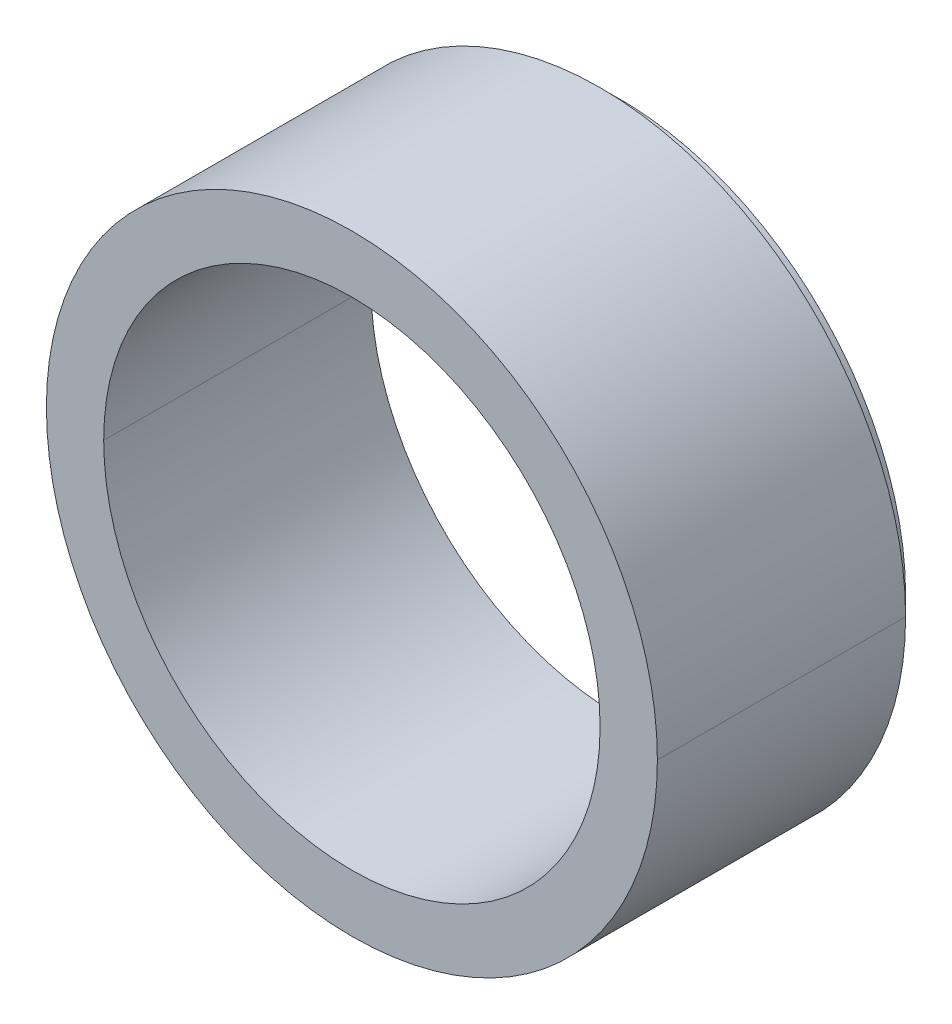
ISO-10303-21;
HEADER;
FILE_DESCRIPTION(('STEP AP214'),'2;1');
FILE_NAME('part.step','',(''),(''),'','','');
FILE_SCHEMA(('AUTOMOTIVE_DESIGN { 1 0 10303 214 1 1 1 1 }'));
ENDSEC;
DATA;
#1=APPLICATION_CONTEXT('core data for automotive mechanical design processes');
#2=APPLICATION_PROTOCOL_DEFINITION('international standard','automotive_design',2000,#1);
#3=PRODUCT_CONTEXT('',#1,'mechanical');
#4=PRODUCT('Part','Part','',(#3));
#5=PRODUCT_RELATED_PRODUCT_CATEGORY('part','',(#4));
#6=PRODUCT_DEFINITION_FORMATION('','',#4);
#7=PRODUCT_DEFINITION_CONTEXT('part definition',#1,'design');
#8=PRODUCT_DEFINITION('design','',#6,#7);
#9=PRODUCT_DEFINITION_SHAPE('','',#8);
#10=(LENGTH_UNIT() NAMED_UNIT(*) SI_UNIT(.MILLI.,.METRE.));
#11=(NAMED_UNIT(*) PLANE_ANGLE_UNIT() SI_UNIT($,.RADIAN.));
#12=(NAMED_UNIT(*) SI_UNIT($,.STERADIAN.) SOLID_ANGLE_UNIT());
#13=UNCERTAINTY_MEASURE_WITH_UNIT(LENGTH_MEASURE(1.E-05),#10,'distance_accuracy_value','');
#14=(GEOMETRIC_REPRESENTATION_CONTEXT(3) GLOBAL_UNCERTAINTY_ASSIGNED_CONTEXT((#13)) GLOBAL_UNIT_ASSIGNED_CONTEXT((#10,
#11,#12)) REPRESENTATION_CONTEXT('',''));
#15=CARTESIAN_POINT('',(0.,0.,0.));
#16=DIRECTION('',(0.,0.,1.));
#17=DIRECTION('',(1.,0.,0.));
#18=AXIS2_PLACEMENT_3D('',#15,#16,#17);
#19=CARTESIAN_POINT('',(15.,0.,1.));
#20=DIRECTION('',(0.,0.,-1.));
#21=DIRECTION('',(0.,-1.,0.));
#22=AXIS2_PLACEMENT_3D('',#19,#20,#21);
#23=PLANE('',#22);
#24=CARTESIAN_POINT('',(0.,0.,1.));
#25=DIRECTION('',(0.,0.,-1.));
#26=DIRECTION('',(-1.,0.,0.));
#27=AXIS2_PLACEMENT_3D('',#24,#25,#26);
#28=CIRCLE('',#27,15.);
#29=CARTESIAN_POINT('',(-15.,0.,1.));
#30=VERTEX_POINT('',#29);
#31=CARTESIAN_POINT('',(15.,0.,1.));
#32=VERTEX_POINT('',#31);
#33=EDGE_CURVE('E265',#30,#32,#28,.T.);
#34=ORIENTED_EDGE('',*,*,#33,.F.);
#35=CARTESIAN_POINT('',(0.,0.,1.));
#36=DIRECTION('',(0.,0.,-1.));
#37=DIRECTION('',(-1.,0.,0.));
#38=AXIS2_PLACEMENT_3D('',#35,#36,#37);
#39=CIRCLE('',#38,15.);
#40=EDGE_CURVE('E10',#32,#30,#39,.T.);
#41=ORIENTED_EDGE('',*,*,#40,.F.);
#42=EDGE_LOOP('',(#34,#41));
#43=FACE_BOUND('',#42,.T.);
#44=CARTESIAN_POINT('',(0.,0.,1.));
#45=DIRECTION('',(0.,0.,-1.));
#46=DIRECTION('',(-1.,0.,0.));
#47=AXIS2_PLACEMENT_3D('',#44,#45,#46);
#48=CIRCLE('',#47,16.);
#49=CARTESIAN_POINT('',(-16.,0.,1.));
#50=VERTEX_POINT('',#49);
#51=CARTESIAN_POINT('',(16.,0.,1.));
#52=VERTEX_POINT('',#51);
#53=EDGE_CURVE('E87',#50,#52,#48,.T.);
#54=ORIENTED_EDGE('',*,*,#53,.T.);
#55=CARTESIAN_POINT('',(0.,0.,1.));
#56=DIRECTION('',(0.,0.,-1.));
#57=DIRECTION('',(-1.,0.,0.));
#58=AXIS2_PLACEMENT_3D('',#55,#56,#57);
#59=CIRCLE('',#58,16.);
#60=EDGE_CURVE('E34',#52,#50,#59,.T.);
#61=ORIENTED_EDGE('',*,*,#60,.T.);
#62=EDGE_LOOP('',(#54,#61));
#63=FACE_BOUND('',#62,.T.);
#64=ADVANCED_FACE('F15',(#43,#63),#23,.T.);
#65=CARTESIAN_POINT('',(0.,0.,-5.82941494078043));
#66=DIRECTION('',(0.,0.,-1.));
#67=DIRECTION('',(-1.,0.,0.));
#68=AXIS2_PLACEMENT_3D('',#65,#66,#67);
#69=CYLINDRICAL_SURFACE('',#68,15.);
#70=DIRECTION('',(0.,0.,-1.));
#71=VECTOR('',#70,1.);
#72=CARTESIAN_POINT('',(15.,0.,-5.82941494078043));
#73=LINE('',#72,#71);
#74=CARTESIAN_POINT('',(15.,0.,0.));
#75=VERTEX_POINT('',#74);
#76=EDGE_CURVE('E258',#32,#75,#73,.T.);
#77=ORIENTED_EDGE('',*,*,#76,.F.);
#78=ORIENTED_EDGE('',*,*,#40,.T.);
#79=DIRECTION('',(0.,0.,-1.));
#80=VECTOR('',#79,1.);
#81=CARTESIAN_POINT('',(-15.,0.,-5.82941494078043));
#82=LINE('',#81,#80);
#83=CARTESIAN_POINT('',(-15.,0.,0.));
#84=VERTEX_POINT('',#83);
#85=EDGE_CURVE('E118',#30,#84,#82,.T.);
#86=ORIENTED_EDGE('',*,*,#85,.T.);
#87=CARTESIAN_POINT('',(0.,0.,0.));
#88=DIRECTION('',(0.,0.,-1.));
#89=DIRECTION('',(-1.,0.,0.));
#90=AXIS2_PLACEMENT_3D('',#87,#88,#89);
#91=CIRCLE('',#90,15.);
#92=EDGE_CURVE('E102',#75,#84,#91,.T.);
#93=ORIENTED_EDGE('',*,*,#92,.F.);
#94=EDGE_LOOP('',(#77,#78,#86,#93));
#95=FACE_BOUND('',#94,.T.);
#96=ADVANCED_FACE('F145',(#95),#69,.T.);
#97=CARTESIAN_POINT('',(0.,0.,14.));
#98=DIRECTION('',(0.,0.,-1.));
#99=DIRECTION('',(-1.,0.,0.));
#100=AXIS2_PLACEMENT_3D('',#97,#98,#99);
#101=CYLINDRICAL_SURFACE('',#100,13.);
#102=DIRECTION('',(0.,0.,-1.));
#103=VECTOR('',#102,1.);
#104=CARTESIAN_POINT('',(13.,0.,14.));
#105=LINE('',#104,#103);
#106=CARTESIAN_POINT('',(13.,0.,14.));
#107=VERTEX_POINT('',#106);
#108=CARTESIAN_POINT('',(13.,0.,0.));
#109=VERTEX_POINT('',#108);
#110=EDGE_CURVE('E123',#107,#109,#105,.T.);
#111=ORIENTED_EDGE('',*,*,#110,.F.);
#112=CARTESIAN_POINT('',(0.,0.,14.));
#113=DIRECTION('',(0.,0.,1.));
#114=DIRECTION('',(1.,0.,0.));
#115=AXIS2_PLACEMENT_3D('',#112,#113,#114);
#116=CIRCLE('',#115,13.);
#117=CARTESIAN_POINT('',(-13.,0.,14.));
#118=VERTEX_POINT('',#117);
#119=EDGE_CURVE('E24',#107,#118,#116,.T.);
#120=ORIENTED_EDGE('',*,*,#119,.T.);
#121=DIRECTION('',(0.,0.,-1.));
#122=VECTOR('',#121,1.);
#123=CARTESIAN_POINT('',(-13.,0.,14.));
#124=LINE('',#123,#122);
#125=CARTESIAN_POINT('',(-13.,0.,0.));
#126=VERTEX_POINT('',#125);
#127=EDGE_CURVE('E92',#118,#126,#124,.T.);
#128=ORIENTED_EDGE('',*,*,#127,.T.);
#129=CARTESIAN_POINT('',(0.,0.,0.));
#130=DIRECTION('',(0.,0.,1.));
#131=DIRECTION('',(1.,0.,0.));
#132=AXIS2_PLACEMENT_3D('',#129,#130,#131);
#133=CIRCLE('',#132,13.);
#134=EDGE_CURVE('E79',#109,#126,#133,.T.);
#135=ORIENTED_EDGE('',*,*,#134,.F.);
#136=EDGE_LOOP('',(#111,#120,#128,#135));
#137=FACE_BOUND('',#136,.T.);
#138=ADVANCED_FACE('F17',(#137),#101,.F.);
#139=CARTESIAN_POINT('',(0.,0.,14.));
#140=DIRECTION('',(0.,0.,1.));
#141=DIRECTION('',(1.,0.,0.));
#142=AXIS2_PLACEMENT_3D('',#139,#140,#141);
#143=PLANE('',#142);
#144=CARTESIAN_POINT('',(0.,0.,14.));
#145=DIRECTION('',(0.,0.,1.));
#146=DIRECTION('',(1.,0.,0.));
#147=AXIS2_PLACEMENT_3D('',#144,#145,#146);
#148=CIRCLE('',#147,13.);
#149=EDGE_CURVE('E120',#118,#107,#148,.T.);
#150=ORIENTED_EDGE('',*,*,#149,.F.);
#151=ORIENTED_EDGE('',*,*,#119,.F.);
#152=EDGE_LOOP('',(#150,#151));
#153=FACE_BOUND('',#152,.T.);
#154=CARTESIAN_POINT('',(0.,0.,14.));
#155=DIRECTION('',(0.,0.,1.));
#156=DIRECTION('',(1.,0.,0.));
#157=AXIS2_PLACEMENT_3D('',#154,#155,#156);
#158=CIRCLE('',#157,16.);
#159=CARTESIAN_POINT('',(-16.,0.,14.));
#160=VERTEX_POINT('',#159);
#161=CARTESIAN_POINT('',(16.,0.,14.));
#162=VERTEX_POINT('',#161);
#163=EDGE_CURVE('E73',#160,#162,#158,.T.);
#164=ORIENTED_EDGE('',*,*,#163,.T.);
#165=CARTESIAN_POINT('',(0.,0.,14.));
#166=DIRECTION('',(0.,0.,1.));
#167=DIRECTION('',(1.,0.,0.));
#168=AXIS2_PLACEMENT_3D('',#165,#166,#167);
#169=CIRCLE('',#168,16.);
#170=EDGE_CURVE('E76',#162,#160,#169,.T.);
#171=ORIENTED_EDGE('',*,*,#170,.T.);
#172=EDGE_LOOP('',(#164,#171));
#173=FACE_BOUND('',#172,.T.);
#174=ADVANCED_FACE('F74',(#153,#173),#143,.T.);
#175=CARTESIAN_POINT('',(0.,0.,14.));
#176=DIRECTION('',(0.,0.,-1.));
#177=DIRECTION('',(-1.,0.,0.));
#178=AXIS2_PLACEMENT_3D('',#175,#176,#177);
#179=CYLINDRICAL_SURFACE('',#178,16.);
#180=DIRECTION('',(0.,0.,-1.));
#181=VECTOR('',#180,1.);
#182=CARTESIAN_POINT('',(16.,0.,14.));
#183=LINE('',#182,#181);
#184=EDGE_CURVE('E82',#162,#52,#183,.T.);
#185=ORIENTED_EDGE('',*,*,#184,.F.);
#186=ORIENTED_EDGE('',*,*,#163,.F.);
#187=DIRECTION('',(0.,0.,-1.));
#188=VECTOR('',#187,1.);
#189=CARTESIAN_POINT('',(-16.,0.,14.));
#190=LINE('',#189,#188);
#191=EDGE_CURVE('E90',#160,#50,#190,.T.);
#192=ORIENTED_EDGE('',*,*,#191,.T.);
#193=ORIENTED_EDGE('',*,*,#60,.F.);
#194=EDGE_LOOP('',(#185,#186,#192,#193));
#195=FACE_BOUND('',#194,.T.);
#196=ADVANCED_FACE('F83',(#195),#179,.T.);
#197=CARTESIAN_POINT('',(0.,0.,0.));
#198=DIRECTION('',(0.,0.,1.));
#199=DIRECTION('',(1.,0.,0.));
#200=AXIS2_PLACEMENT_3D('',#197,#198,#199);
#201=PLANE('',#200);
#202=CARTESIAN_POINT('',(0.,0.,0.));
#203=DIRECTION('',(0.,0.,1.));
#204=DIRECTION('',(1.,0.,0.));
#205=AXIS2_PLACEMENT_3D('',#202,#203,#204);
#206=CIRCLE('',#205,13.);
#207=EDGE_CURVE('E98',#126,#109,#206,.T.);
#208=ORIENTED_EDGE('',*,*,#207,.T.);
#209=ORIENTED_EDGE('',*,*,#134,.T.);
#210=EDGE_LOOP('',(#208,#209));
#211=FACE_BOUND('',#210,.T.);
#212=CARTESIAN_POINT('',(0.,0.,0.));
#213=DIRECTION('',(0.,0.,-1.));
#214=DIRECTION('',(-1.,0.,0.));
#215=AXIS2_PLACEMENT_3D('',#212,#213,#214);
#216=CIRCLE('',#215,15.);
#217=EDGE_CURVE('E262',#84,#75,#216,.T.);
#218=ORIENTED_EDGE('',*,*,#217,.T.);
#219=ORIENTED_EDGE('',*,*,#92,.T.);
#220=EDGE_LOOP('',(#218,#219));
#221=FACE_BOUND('',#220,.T.);
#222=ADVANCED_FACE('F132',(#211,#221),#201,.F.);
#223=CARTESIAN_POINT('',(0.,0.,14.));
#224=DIRECTION('',(0.,0.,-1.));
#225=DIRECTION('',(-1.,0.,0.));
#226=AXIS2_PLACEMENT_3D('',#223,#224,#225);
#227=CYLINDRICAL_SURFACE('',#226,16.);
#228=ORIENTED_EDGE('',*,*,#170,.F.);
#229=ORIENTED_EDGE('',*,*,#184,.T.);
#230=ORIENTED_EDGE('',*,*,#53,.F.);
#231=ORIENTED_EDGE('',*,*,#191,.F.);
#232=EDGE_LOOP('',(#228,#229,#230,#231));
#233=FACE_BOUND('',#232,.T.);
#234=ADVANCED_FACE('F89',(#233),#227,.T.);
#235=CARTESIAN_POINT('',(0.,0.,14.));
#236=DIRECTION('',(0.,0.,-1.));
#237=DIRECTION('',(-1.,0.,0.));
#238=AXIS2_PLACEMENT_3D('',#235,#236,#237);
#239=CYLINDRICAL_SURFACE('',#238,13.);
#240=ORIENTED_EDGE('',*,*,#149,.T.);
#241=ORIENTED_EDGE('',*,*,#110,.T.);
#242=ORIENTED_EDGE('',*,*,#207,.F.);
#243=ORIENTED_EDGE('',*,*,#127,.F.);
#244=EDGE_LOOP('',(#240,#241,#242,#243));
#245=FACE_BOUND('',#244,.T.);
#246=ADVANCED_FACE('F135',(#245),#239,.F.);
#247=CARTESIAN_POINT('',(0.,0.,-5.82941494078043));
#248=DIRECTION('',(0.,0.,-1.));
#249=DIRECTION('',(-1.,0.,0.));
#250=AXIS2_PLACEMENT_3D('',#247,#248,#249);
#251=CYLINDRICAL_SURFACE('',#250,15.);
#252=ORIENTED_EDGE('',*,*,#33,.T.);
#253=ORIENTED_EDGE('',*,*,#76,.T.);
#254=ORIENTED_EDGE('',*,*,#217,.F.);
#255=ORIENTED_EDGE('',*,*,#85,.F.);
#256=EDGE_LOOP('',(#252,#253,#254,#255));
#257=FACE_BOUND('',#256,.T.);
#258=ADVANCED_FACE('F177',(#257),#251,.T.);
#259=CLOSED_SHELL('',(#64,#96,#138,#174,#196,#222,#234,#246,#258));
#260=MANIFOLD_SOLID_BREP('B1',#259);
#261=ADVANCED_BREP_SHAPE_REPRESENTATION('',(#18,#260),#14);
#262=SHAPE_DEFINITION_REPRESENTATION(#9,#261);
ENDSEC;
END-ISO-10303-21;
